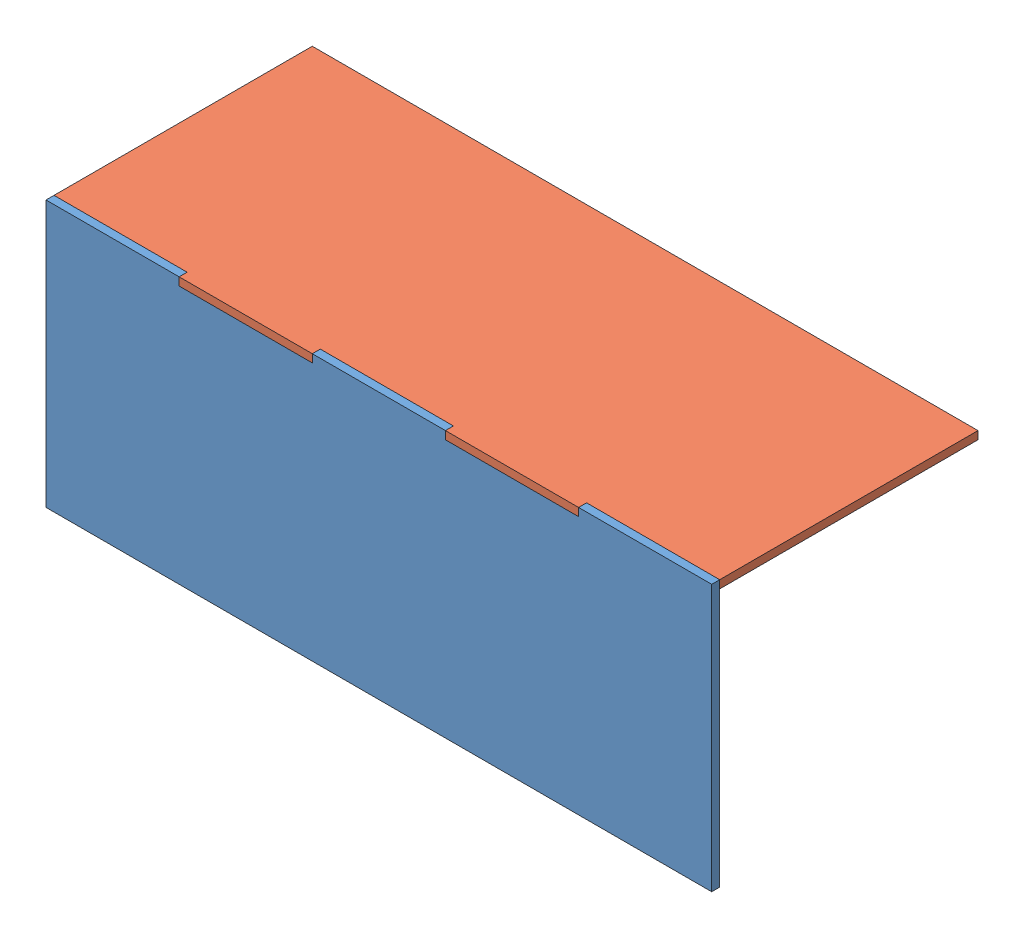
SolidWorks assembly Assem2.sldasm, configuration Default (file format 10000). Lengths in mm.
Overall size (500 200 200).
2 component instances, 2 part files, 3 mates.
Components (placement in the parent):
- side1-1: side1.SLDPRT [Default] at (379.0725 109.4561 433.4356) size (500 200 6)
- side2-1: side2.SLDPRT [Default] at (401.9798 323.4972 165.5082) x (1 0 0) z (0 -1 0) size (500 200 6)
Mates (geometry in assembly coordinates):
- Coincident2: coincident: plane of side1-1 through (-114.9344 323.4972 439.4356) normal (0 1 0); plane of side2-1 through (401.9798 323.4972 165.5082) normal (0 1 0)
- Coincident3: coincident: plane of side1-1 through (379.0725 109.4561 439.4356) normal (0 0 1); plane of side2-1 through (-14.9344 317.4972 439.4356) normal (0 0 1)
- Coincident4: coincident aligned: plane of side1-1 through (-114.9344 323.4972 439.4356) normal (-1 0 0); plane of side2-1 through (-114.9344 317.4972 433.4356) normal (-1 0 0)
